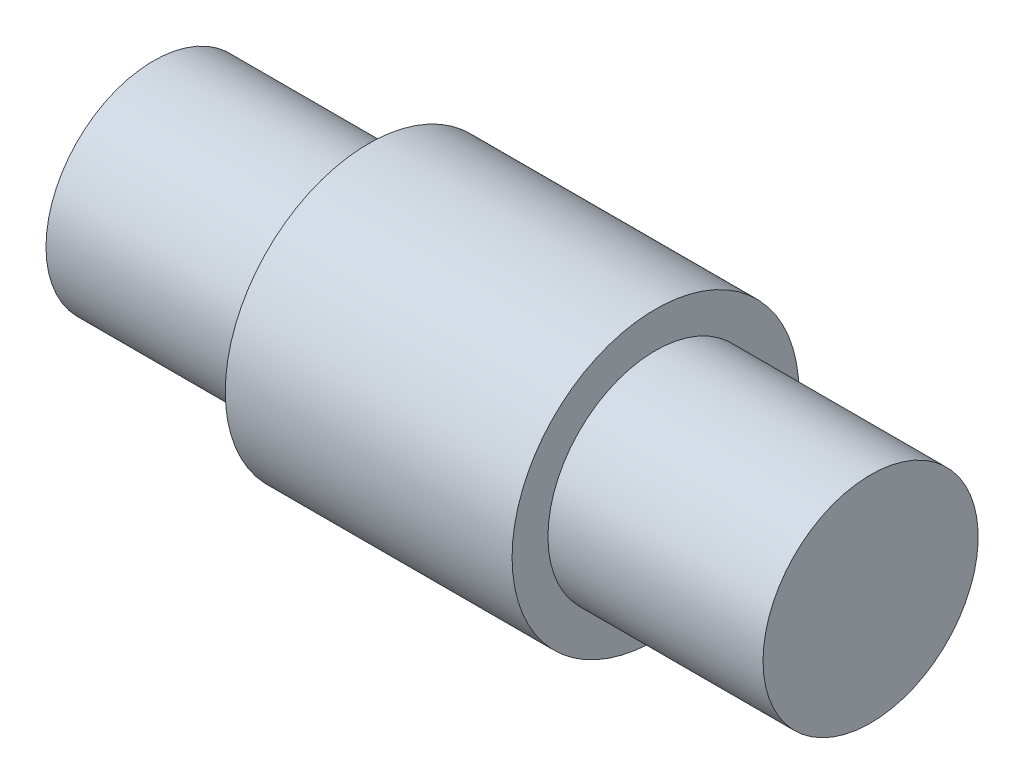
ISO-10303-21;
HEADER;
FILE_DESCRIPTION(('STEP AP214'),'2;1');
FILE_NAME('part.step','',(''),(''),'','','');
FILE_SCHEMA(('AUTOMOTIVE_DESIGN { 1 0 10303 214 1 1 1 1 }'));
ENDSEC;
DATA;
#1=APPLICATION_CONTEXT('core data for automotive mechanical design processes');
#2=APPLICATION_PROTOCOL_DEFINITION('international standard','automotive_design',2000,#1);
#3=PRODUCT_CONTEXT('',#1,'mechanical');
#4=PRODUCT('Part','Part','',(#3));
#5=PRODUCT_RELATED_PRODUCT_CATEGORY('part','',(#4));
#6=PRODUCT_DEFINITION_FORMATION('','',#4);
#7=PRODUCT_DEFINITION_CONTEXT('part definition',#1,'design');
#8=PRODUCT_DEFINITION('design','',#6,#7);
#9=PRODUCT_DEFINITION_SHAPE('','',#8);
#10=(LENGTH_UNIT() NAMED_UNIT(*) SI_UNIT(.MILLI.,.METRE.));
#11=(NAMED_UNIT(*) PLANE_ANGLE_UNIT() SI_UNIT($,.RADIAN.));
#12=(NAMED_UNIT(*) SI_UNIT($,.STERADIAN.) SOLID_ANGLE_UNIT());
#13=UNCERTAINTY_MEASURE_WITH_UNIT(LENGTH_MEASURE(1.E-05),#10,'distance_accuracy_value','');
#14=(GEOMETRIC_REPRESENTATION_CONTEXT(3) GLOBAL_UNCERTAINTY_ASSIGNED_CONTEXT((#13)) GLOBAL_UNIT_ASSIGNED_CONTEXT((#10,
#11,#12)) REPRESENTATION_CONTEXT('',''));
#15=CARTESIAN_POINT('',(0.,0.,0.));
#16=DIRECTION('',(0.,0.,1.));
#17=DIRECTION('',(1.,0.,0.));
#18=AXIS2_PLACEMENT_3D('',#15,#16,#17);
#19=CARTESIAN_POINT('',(-8.59151712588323,-3.,0.));
#20=DIRECTION('',(-1.,0.,0.));
#21=DIRECTION('',(0.,0.,1.));
#22=AXIS2_PLACEMENT_3D('',#19,#20,#21);
#23=PLANE('',#22);
#24=CARTESIAN_POINT('',(-8.59151712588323,0.,0.));
#25=DIRECTION('',(-1.,0.,0.));
#26=DIRECTION('',(0.,0.,1.));
#27=AXIS2_PLACEMENT_3D('',#24,#25,#26);
#28=CIRCLE('',#27,3.);
#29=CARTESIAN_POINT('',(-8.59151712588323,0.,3.));
#30=VERTEX_POINT('',#29);
#31=EDGE_CURVE('E53',#30,#30,#28,.T.);
#32=ORIENTED_EDGE('',*,*,#31,.T.);
#33=EDGE_LOOP('',(#32));
#34=FACE_BOUND('',#33,.T.);
#35=ADVANCED_FACE('F31',(#34),#23,.T.);
#36=CARTESIAN_POINT('',(11.4084828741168,0.,0.));
#37=DIRECTION('',(1.,0.,0.));
#38=DIRECTION('',(0.,0.,-1.));
#39=AXIS2_PLACEMENT_3D('',#36,#37,#38);
#40=PLANE('',#39);
#41=CARTESIAN_POINT('',(11.4084828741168,0.,0.));
#42=DIRECTION('',(-1.,0.,0.));
#43=DIRECTION('',(0.,0.,1.));
#44=AXIS2_PLACEMENT_3D('',#41,#42,#43);
#45=CIRCLE('',#44,3.);
#46=CARTESIAN_POINT('',(11.4084828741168,0.,3.));
#47=VERTEX_POINT('',#46);
#48=EDGE_CURVE('E10',#47,#47,#45,.T.);
#49=ORIENTED_EDGE('',*,*,#48,.F.);
#50=EDGE_LOOP('',(#49));
#51=FACE_BOUND('',#50,.T.);
#52=ADVANCED_FACE('F70',(#51),#40,.T.);
#53=CARTESIAN_POINT('',(-8.59151712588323,0.,0.));
#54=DIRECTION('',(-1.,0.,0.));
#55=DIRECTION('',(0.,0.,1.));
#56=AXIS2_PLACEMENT_3D('',#53,#54,#55);
#57=CYLINDRICAL_SURFACE('',#56,3.);
#58=ORIENTED_EDGE('',*,*,#48,.T.);
#59=EDGE_LOOP('',(#58));
#60=FACE_BOUND('',#59,.T.);
#61=CARTESIAN_POINT('',(5.40848287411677,0.,0.));
#62=DIRECTION('',(-1.,0.,0.));
#63=DIRECTION('',(0.,0.,1.));
#64=AXIS2_PLACEMENT_3D('',#61,#62,#63);
#65=CIRCLE('',#64,3.);
#66=CARTESIAN_POINT('',(5.40848287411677,0.,3.));
#67=VERTEX_POINT('',#66);
#68=EDGE_CURVE('E37',#67,#67,#65,.T.);
#69=ORIENTED_EDGE('',*,*,#68,.F.);
#70=EDGE_LOOP('',(#69));
#71=FACE_BOUND('',#70,.T.);
#72=ADVANCED_FACE('F74',(#60,#71),#57,.T.);
#73=CARTESIAN_POINT('',(5.40848287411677,-3.,0.));
#74=DIRECTION('',(1.,0.,0.));
#75=DIRECTION('',(0.,0.,-1.));
#76=AXIS2_PLACEMENT_3D('',#73,#74,#75);
#77=PLANE('',#76);
#78=ORIENTED_EDGE('',*,*,#68,.T.);
#79=EDGE_LOOP('',(#78));
#80=FACE_BOUND('',#79,.T.);
#81=CARTESIAN_POINT('',(5.40848287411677,0.,0.));
#82=DIRECTION('',(-1.,0.,0.));
#83=DIRECTION('',(0.,0.,1.));
#84=AXIS2_PLACEMENT_3D('',#81,#82,#83);
#85=CIRCLE('',#84,4.);
#86=CARTESIAN_POINT('',(5.40848287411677,0.,4.));
#87=VERTEX_POINT('',#86);
#88=EDGE_CURVE('E41',#87,#87,#85,.T.);
#89=ORIENTED_EDGE('',*,*,#88,.F.);
#90=EDGE_LOOP('',(#89));
#91=FACE_BOUND('',#90,.T.);
#92=ADVANCED_FACE('F79',(#80,#91),#77,.T.);
#93=CARTESIAN_POINT('',(-8.59151712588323,0.,0.));
#94=DIRECTION('',(-1.,0.,0.));
#95=DIRECTION('',(0.,0.,1.));
#96=AXIS2_PLACEMENT_3D('',#93,#94,#95);
#97=CYLINDRICAL_SURFACE('',#96,4.);
#98=ORIENTED_EDGE('',*,*,#88,.T.);
#99=EDGE_LOOP('',(#98));
#100=FACE_BOUND('',#99,.T.);
#101=CARTESIAN_POINT('',(-2.59151712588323,0.,0.));
#102=DIRECTION('',(-1.,0.,0.));
#103=DIRECTION('',(0.,0.,1.));
#104=AXIS2_PLACEMENT_3D('',#101,#102,#103);
#105=CIRCLE('',#104,4.);
#106=CARTESIAN_POINT('',(-2.59151712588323,0.,4.));
#107=VERTEX_POINT('',#106);
#108=EDGE_CURVE('E45',#107,#107,#105,.T.);
#109=ORIENTED_EDGE('',*,*,#108,.F.);
#110=EDGE_LOOP('',(#109));
#111=FACE_BOUND('',#110,.T.);
#112=ADVANCED_FACE('F66',(#100,#111),#97,.T.);
#113=CARTESIAN_POINT('',(-2.59151712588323,-4.,0.));
#114=DIRECTION('',(-1.,0.,0.));
#115=DIRECTION('',(0.,0.,1.));
#116=AXIS2_PLACEMENT_3D('',#113,#114,#115);
#117=PLANE('',#116);
#118=ORIENTED_EDGE('',*,*,#108,.T.);
#119=EDGE_LOOP('',(#118));
#120=FACE_BOUND('',#119,.T.);
#121=CARTESIAN_POINT('',(-2.59151712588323,0.,0.));
#122=DIRECTION('',(-1.,0.,0.));
#123=DIRECTION('',(0.,0.,1.));
#124=AXIS2_PLACEMENT_3D('',#121,#122,#123);
#125=CIRCLE('',#124,3.);
#126=CARTESIAN_POINT('',(-2.59151712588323,0.,3.));
#127=VERTEX_POINT('',#126);
#128=EDGE_CURVE('E50',#127,#127,#125,.T.);
#129=ORIENTED_EDGE('',*,*,#128,.F.);
#130=EDGE_LOOP('',(#129));
#131=FACE_BOUND('',#130,.T.);
#132=ADVANCED_FACE('F60',(#120,#131),#117,.T.);
#133=CARTESIAN_POINT('',(-8.59151712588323,0.,0.));
#134=DIRECTION('',(-1.,0.,0.));
#135=DIRECTION('',(0.,0.,1.));
#136=AXIS2_PLACEMENT_3D('',#133,#134,#135);
#137=CYLINDRICAL_SURFACE('',#136,3.);
#138=ORIENTED_EDGE('',*,*,#128,.T.);
#139=EDGE_LOOP('',(#138));
#140=FACE_BOUND('',#139,.T.);
#141=ORIENTED_EDGE('',*,*,#31,.F.);
#142=EDGE_LOOP('',(#141));
#143=FACE_BOUND('',#142,.T.);
#144=ADVANCED_FACE('F58',(#140,#143),#137,.T.);
#145=CLOSED_SHELL('',(#35,#52,#72,#92,#112,#132,#144));
#146=MANIFOLD_SOLID_BREP('B2',#145);
#147=ADVANCED_BREP_SHAPE_REPRESENTATION('',(#18,#146),#14);
#148=SHAPE_DEFINITION_REPRESENTATION(#9,#147);
ENDSEC;
END-ISO-10303-21;
